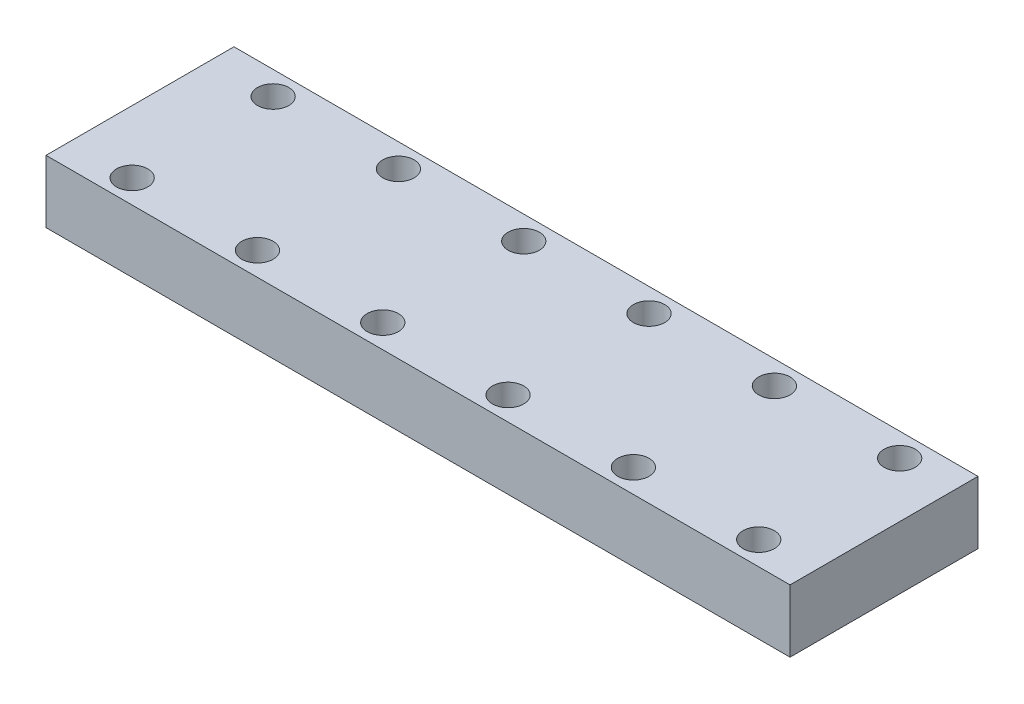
ISO-10303-21;
HEADER;
FILE_DESCRIPTION(('STEP AP214'),'2;1');
FILE_NAME('part.step','',(''),(''),'','','');
FILE_SCHEMA(('AUTOMOTIVE_DESIGN { 1 0 10303 214 1 1 1 1 }'));
ENDSEC;
DATA;
#1=APPLICATION_CONTEXT('core data for automotive mechanical design processes');
#2=APPLICATION_PROTOCOL_DEFINITION('international standard','automotive_design',2000,#1);
#3=PRODUCT_CONTEXT('',#1,'mechanical');
#4=PRODUCT('Part','Part','',(#3));
#5=PRODUCT_RELATED_PRODUCT_CATEGORY('part','',(#4));
#6=PRODUCT_DEFINITION_FORMATION('','',#4);
#7=PRODUCT_DEFINITION_CONTEXT('part definition',#1,'design');
#8=PRODUCT_DEFINITION('design','',#6,#7);
#9=PRODUCT_DEFINITION_SHAPE('','',#8);
#10=(LENGTH_UNIT() NAMED_UNIT(*) SI_UNIT(.MILLI.,.METRE.));
#11=(NAMED_UNIT(*) PLANE_ANGLE_UNIT() SI_UNIT($,.RADIAN.));
#12=(NAMED_UNIT(*) SI_UNIT($,.STERADIAN.) SOLID_ANGLE_UNIT());
#13=UNCERTAINTY_MEASURE_WITH_UNIT(LENGTH_MEASURE(1.E-05),#10,'distance_accuracy_value','');
#14=(GEOMETRIC_REPRESENTATION_CONTEXT(3) GLOBAL_UNCERTAINTY_ASSIGNED_CONTEXT((#13)) GLOBAL_UNIT_ASSIGNED_CONTEXT((#10,
#11,#12)) REPRESENTATION_CONTEXT('',''));
#15=CARTESIAN_POINT('',(0.,0.,0.));
#16=DIRECTION('',(0.,0.,1.));
#17=DIRECTION('',(1.,0.,0.));
#18=AXIS2_PLACEMENT_3D('',#15,#16,#17);
#19=CARTESIAN_POINT('',(0.,8.,0.));
#20=DIRECTION('',(0.,1.,0.));
#21=DIRECTION('',(0.,0.,1.));
#22=AXIS2_PLACEMENT_3D('',#19,#20,#21);
#23=PLANE('',#22);
#24=CARTESIAN_POINT('',(53.7092511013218,8.,7.83700440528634));
#25=DIRECTION('',(0.,1.,0.));
#26=DIRECTION('',(0.,0.,1.));
#27=AXIS2_PLACEMENT_3D('',#24,#25,#26);
#28=CIRCLE('',#27,2.);
#29=CARTESIAN_POINT('',(53.7092511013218,8.,9.83700440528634));
#30=VERTEX_POINT('',#29);
#31=EDGE_CURVE('E171',#30,#30,#28,.T.);
#32=ORIENTED_EDGE('',*,*,#31,.F.);
#33=EDGE_LOOP('',(#32));
#34=FACE_BOUND('',#33,.T.);
#35=CARTESIAN_POINT('',(21.7092511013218,8.,7.83700440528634));
#36=DIRECTION('',(0.,1.,0.));
#37=DIRECTION('',(0.,0.,1.));
#38=AXIS2_PLACEMENT_3D('',#35,#36,#37);
#39=CIRCLE('',#38,2.);
#40=CARTESIAN_POINT('',(21.7092511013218,8.,9.83700440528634));
#41=VERTEX_POINT('',#40);
#42=EDGE_CURVE('E159',#41,#41,#39,.T.);
#43=ORIENTED_EDGE('',*,*,#42,.F.);
#44=EDGE_LOOP('',(#43));
#45=FACE_BOUND('',#44,.T.);
#46=CARTESIAN_POINT('',(-10.2907488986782,8.,7.83700440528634));
#47=DIRECTION('',(0.,1.,0.));
#48=DIRECTION('',(0.,0.,1.));
#49=AXIS2_PLACEMENT_3D('',#46,#47,#48);
#50=CIRCLE('',#49,2.);
#51=CARTESIAN_POINT('',(-10.2907488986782,8.,9.83700440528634));
#52=VERTEX_POINT('',#51);
#53=EDGE_CURVE('E147',#52,#52,#50,.T.);
#54=ORIENTED_EDGE('',*,*,#53,.F.);
#55=EDGE_LOOP('',(#54));
#56=FACE_BOUND('',#55,.T.);
#57=CARTESIAN_POINT('',(53.7092511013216,8.,-10.1629955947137));
#58=DIRECTION('',(0.,1.,0.));
#59=DIRECTION('',(0.,0.,1.));
#60=AXIS2_PLACEMENT_3D('',#57,#58,#59);
#61=CIRCLE('',#60,2.);
#62=CARTESIAN_POINT('',(53.7092511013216,8.,-8.16299559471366));
#63=VERTEX_POINT('',#62);
#64=EDGE_CURVE('E135',#63,#63,#61,.T.);
#65=ORIENTED_EDGE('',*,*,#64,.F.);
#66=EDGE_LOOP('',(#65));
#67=FACE_BOUND('',#66,.T.);
#68=CARTESIAN_POINT('',(21.7092511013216,8.,-10.1629955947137));
#69=DIRECTION('',(0.,1.,0.));
#70=DIRECTION('',(0.,0.,1.));
#71=AXIS2_PLACEMENT_3D('',#68,#69,#70);
#72=CIRCLE('',#71,2.);
#73=CARTESIAN_POINT('',(21.7092511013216,8.,-8.16299559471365));
#74=VERTEX_POINT('',#73);
#75=EDGE_CURVE('E123',#74,#74,#72,.T.);
#76=ORIENTED_EDGE('',*,*,#75,.F.);
#77=EDGE_LOOP('',(#76));
#78=FACE_BOUND('',#77,.T.);
#79=CARTESIAN_POINT('',(-10.2907488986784,8.,-10.1629955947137));
#80=DIRECTION('',(0.,1.,0.));
#81=DIRECTION('',(0.,0.,1.));
#82=AXIS2_PLACEMENT_3D('',#79,#80,#81);
#83=CIRCLE('',#82,2.);
#84=CARTESIAN_POINT('',(-10.2907488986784,8.,-8.16299559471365));
#85=VERTEX_POINT('',#84);
#86=EDGE_CURVE('E102',#85,#85,#83,.T.);
#87=ORIENTED_EDGE('',*,*,#86,.F.);
#88=EDGE_LOOP('',(#87));
#89=FACE_BOUND('',#88,.T.);
#90=DIRECTION('',(0.,0.,1.));
#91=VECTOR('',#90,1.);
#92=CARTESIAN_POINT('',(-18.2907488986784,8.,-13.1629955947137));
#93=LINE('',#92,#91);
#94=CARTESIAN_POINT('',(-18.2907488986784,8.,-13.1629955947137));
#95=VERTEX_POINT('',#94);
#96=CARTESIAN_POINT('',(-18.2907488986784,8.,10.8370044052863));
#97=VERTEX_POINT('',#96);
#98=EDGE_CURVE('E87',#95,#97,#93,.T.);
#99=ORIENTED_EDGE('',*,*,#98,.T.);
#100=DIRECTION('',(1.,0.,0.));
#101=VECTOR('',#100,1.);
#102=CARTESIAN_POINT('',(-18.2907488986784,8.,10.8370044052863));
#103=LINE('',#102,#101);
#104=CARTESIAN_POINT('',(76.7092511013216,8.,10.8370044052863));
#105=VERTEX_POINT('',#104);
#106=EDGE_CURVE('E82',#97,#105,#103,.T.);
#107=ORIENTED_EDGE('',*,*,#106,.T.);
#108=DIRECTION('',(0.,0.,-1.));
#109=VECTOR('',#108,1.);
#110=CARTESIAN_POINT('',(76.7092511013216,8.,-13.1629955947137));
#111=LINE('',#110,#109);
#112=CARTESIAN_POINT('',(76.7092511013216,8.,-13.1629955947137));
#113=VERTEX_POINT('',#112);
#114=EDGE_CURVE('E85',#105,#113,#111,.T.);
#115=ORIENTED_EDGE('',*,*,#114,.T.);
#116=DIRECTION('',(-1.,0.,0.));
#117=VECTOR('',#116,1.);
#118=CARTESIAN_POINT('',(-18.2907488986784,8.,-13.1629955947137));
#119=LINE('',#118,#117);
#120=EDGE_CURVE('E52',#113,#95,#119,.T.);
#121=ORIENTED_EDGE('',*,*,#120,.T.);
#122=EDGE_LOOP('',(#99,#107,#115,#121));
#123=FACE_BOUND('',#122,.T.);
#124=CARTESIAN_POINT('',(5.70925110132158,8.,-10.1629955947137));
#125=DIRECTION('',(0.,1.,0.));
#126=DIRECTION('',(0.,0.,1.));
#127=AXIS2_PLACEMENT_3D('',#124,#125,#126);
#128=CIRCLE('',#127,2.);
#129=CARTESIAN_POINT('',(5.70925110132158,8.,-8.16299559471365));
#130=VERTEX_POINT('',#129);
#131=EDGE_CURVE('E117',#130,#130,#128,.T.);
#132=ORIENTED_EDGE('',*,*,#131,.F.);
#133=EDGE_LOOP('',(#132));
#134=FACE_BOUND('',#133,.T.);
#135=CARTESIAN_POINT('',(37.7092511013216,8.,-10.1629955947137));
#136=DIRECTION('',(0.,1.,0.));
#137=DIRECTION('',(0.,0.,1.));
#138=AXIS2_PLACEMENT_3D('',#135,#136,#137);
#139=CIRCLE('',#138,2.);
#140=CARTESIAN_POINT('',(37.7092511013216,8.,-8.16299559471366));
#141=VERTEX_POINT('',#140);
#142=EDGE_CURVE('E129',#141,#141,#139,.T.);
#143=ORIENTED_EDGE('',*,*,#142,.F.);
#144=EDGE_LOOP('',(#143));
#145=FACE_BOUND('',#144,.T.);
#146=CARTESIAN_POINT('',(69.7092511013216,8.,-10.1629955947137));
#147=DIRECTION('',(0.,1.,0.));
#148=DIRECTION('',(0.,0.,1.));
#149=AXIS2_PLACEMENT_3D('',#146,#147,#148);
#150=CIRCLE('',#149,2.);
#151=CARTESIAN_POINT('',(69.7092511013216,8.,-8.16299559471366));
#152=VERTEX_POINT('',#151);
#153=EDGE_CURVE('E141',#152,#152,#150,.T.);
#154=ORIENTED_EDGE('',*,*,#153,.F.);
#155=EDGE_LOOP('',(#154));
#156=FACE_BOUND('',#155,.T.);
#157=CARTESIAN_POINT('',(5.70925110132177,8.,7.83700440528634));
#158=DIRECTION('',(0.,1.,0.));
#159=DIRECTION('',(0.,0.,1.));
#160=AXIS2_PLACEMENT_3D('',#157,#158,#159);
#161=CIRCLE('',#160,2.);
#162=CARTESIAN_POINT('',(5.70925110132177,8.,9.83700440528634));
#163=VERTEX_POINT('',#162);
#164=EDGE_CURVE('E153',#163,#163,#161,.T.);
#165=ORIENTED_EDGE('',*,*,#164,.F.);
#166=EDGE_LOOP('',(#165));
#167=FACE_BOUND('',#166,.T.);
#168=CARTESIAN_POINT('',(37.7092511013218,8.,7.83700440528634));
#169=DIRECTION('',(0.,1.,0.));
#170=DIRECTION('',(0.,0.,1.));
#171=AXIS2_PLACEMENT_3D('',#168,#169,#170);
#172=CIRCLE('',#171,2.);
#173=CARTESIAN_POINT('',(37.7092511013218,8.,9.83700440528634));
#174=VERTEX_POINT('',#173);
#175=EDGE_CURVE('E165',#174,#174,#172,.T.);
#176=ORIENTED_EDGE('',*,*,#175,.F.);
#177=EDGE_LOOP('',(#176));
#178=FACE_BOUND('',#177,.T.);
#179=CARTESIAN_POINT('',(69.7092511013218,8.,7.83700440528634));
#180=DIRECTION('',(0.,1.,0.));
#181=DIRECTION('',(0.,0.,1.));
#182=AXIS2_PLACEMENT_3D('',#179,#180,#181);
#183=CIRCLE('',#182,2.);
#184=CARTESIAN_POINT('',(69.7092511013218,8.,9.83700440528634));
#185=VERTEX_POINT('',#184);
#186=EDGE_CURVE('E177',#185,#185,#183,.T.);
#187=ORIENTED_EDGE('',*,*,#186,.F.);
#188=EDGE_LOOP('',(#187));
#189=FACE_BOUND('',#188,.T.);
#190=ADVANCED_FACE('F35',(#34,#45,#56,#67,#78,#89,#123,#134,#145,#156,#167,#178,#189),#23,.T.);
#191=CARTESIAN_POINT('',(0.,0.,0.));
#192=DIRECTION('',(0.,1.,0.));
#193=DIRECTION('',(0.,0.,1.));
#194=AXIS2_PLACEMENT_3D('',#191,#192,#193);
#195=PLANE('',#194);
#196=DIRECTION('',(0.,0.,1.));
#197=VECTOR('',#196,1.);
#198=CARTESIAN_POINT('',(-18.2907488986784,0.,-13.1629955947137));
#199=LINE('',#198,#197);
#200=CARTESIAN_POINT('',(-18.2907488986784,0.,-13.1629955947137));
#201=VERTEX_POINT('',#200);
#202=CARTESIAN_POINT('',(-18.2907488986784,0.,10.8370044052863));
#203=VERTEX_POINT('',#202);
#204=EDGE_CURVE('E99',#201,#203,#199,.T.);
#205=ORIENTED_EDGE('',*,*,#204,.F.);
#206=DIRECTION('',(-1.,0.,0.));
#207=VECTOR('',#206,1.);
#208=CARTESIAN_POINT('',(-18.2907488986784,0.,-13.1629955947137));
#209=LINE('',#208,#207);
#210=CARTESIAN_POINT('',(76.7092511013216,0.,-13.1629955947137));
#211=VERTEX_POINT('',#210);
#212=EDGE_CURVE('E75',#211,#201,#209,.T.);
#213=ORIENTED_EDGE('',*,*,#212,.F.);
#214=DIRECTION('',(0.,0.,-1.));
#215=VECTOR('',#214,1.);
#216=CARTESIAN_POINT('',(76.7092511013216,0.,-13.1629955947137));
#217=LINE('',#216,#215);
#218=CARTESIAN_POINT('',(76.7092511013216,0.,10.8370044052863));
#219=VERTEX_POINT('',#218);
#220=EDGE_CURVE('E69',#219,#211,#217,.T.);
#221=ORIENTED_EDGE('',*,*,#220,.F.);
#222=DIRECTION('',(1.,0.,0.));
#223=VECTOR('',#222,1.);
#224=CARTESIAN_POINT('',(-18.2907488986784,0.,10.8370044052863));
#225=LINE('',#224,#223);
#226=EDGE_CURVE('E91',#203,#219,#225,.T.);
#227=ORIENTED_EDGE('',*,*,#226,.F.);
#228=EDGE_LOOP('',(#205,#213,#221,#227));
#229=FACE_BOUND('',#228,.T.);
#230=CARTESIAN_POINT('',(-10.2907488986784,0.,-10.1629955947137));
#231=DIRECTION('',(0.,1.,0.));
#232=DIRECTION('',(0.,0.,1.));
#233=AXIS2_PLACEMENT_3D('',#230,#231,#232);
#234=CIRCLE('',#233,2.);
#235=CARTESIAN_POINT('',(-10.2907488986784,0.,-8.16299559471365));
#236=VERTEX_POINT('',#235);
#237=EDGE_CURVE('E114',#236,#236,#234,.T.);
#238=ORIENTED_EDGE('',*,*,#237,.T.);
#239=EDGE_LOOP('',(#238));
#240=FACE_BOUND('',#239,.T.);
#241=CARTESIAN_POINT('',(5.70925110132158,0.,-10.1629955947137));
#242=DIRECTION('',(0.,1.,0.));
#243=DIRECTION('',(0.,0.,1.));
#244=AXIS2_PLACEMENT_3D('',#241,#242,#243);
#245=CIRCLE('',#244,2.);
#246=CARTESIAN_POINT('',(5.70925110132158,0.,-8.16299559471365));
#247=VERTEX_POINT('',#246);
#248=EDGE_CURVE('E120',#247,#247,#245,.T.);
#249=ORIENTED_EDGE('',*,*,#248,.T.);
#250=EDGE_LOOP('',(#249));
#251=FACE_BOUND('',#250,.T.);
#252=CARTESIAN_POINT('',(21.7092511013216,0.,-10.1629955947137));
#253=DIRECTION('',(0.,1.,0.));
#254=DIRECTION('',(0.,0.,1.));
#255=AXIS2_PLACEMENT_3D('',#252,#253,#254);
#256=CIRCLE('',#255,2.);
#257=CARTESIAN_POINT('',(21.7092511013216,0.,-8.16299559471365));
#258=VERTEX_POINT('',#257);
#259=EDGE_CURVE('E126',#258,#258,#256,.T.);
#260=ORIENTED_EDGE('',*,*,#259,.T.);
#261=EDGE_LOOP('',(#260));
#262=FACE_BOUND('',#261,.T.);
#263=CARTESIAN_POINT('',(37.7092511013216,0.,-10.1629955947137));
#264=DIRECTION('',(0.,1.,0.));
#265=DIRECTION('',(0.,0.,1.));
#266=AXIS2_PLACEMENT_3D('',#263,#264,#265);
#267=CIRCLE('',#266,2.);
#268=CARTESIAN_POINT('',(37.7092511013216,0.,-8.16299559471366));
#269=VERTEX_POINT('',#268);
#270=EDGE_CURVE('E132',#269,#269,#267,.T.);
#271=ORIENTED_EDGE('',*,*,#270,.T.);
#272=EDGE_LOOP('',(#271));
#273=FACE_BOUND('',#272,.T.);
#274=CARTESIAN_POINT('',(53.7092511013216,0.,-10.1629955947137));
#275=DIRECTION('',(0.,1.,0.));
#276=DIRECTION('',(0.,0.,1.));
#277=AXIS2_PLACEMENT_3D('',#274,#275,#276);
#278=CIRCLE('',#277,2.);
#279=CARTESIAN_POINT('',(53.7092511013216,0.,-8.16299559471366));
#280=VERTEX_POINT('',#279);
#281=EDGE_CURVE('E138',#280,#280,#278,.T.);
#282=ORIENTED_EDGE('',*,*,#281,.T.);
#283=EDGE_LOOP('',(#282));
#284=FACE_BOUND('',#283,.T.);
#285=CARTESIAN_POINT('',(69.7092511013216,0.,-10.1629955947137));
#286=DIRECTION('',(0.,1.,0.));
#287=DIRECTION('',(0.,0.,1.));
#288=AXIS2_PLACEMENT_3D('',#285,#286,#287);
#289=CIRCLE('',#288,2.);
#290=CARTESIAN_POINT('',(69.7092511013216,0.,-8.16299559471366));
#291=VERTEX_POINT('',#290);
#292=EDGE_CURVE('E144',#291,#291,#289,.T.);
#293=ORIENTED_EDGE('',*,*,#292,.T.);
#294=EDGE_LOOP('',(#293));
#295=FACE_BOUND('',#294,.T.);
#296=CARTESIAN_POINT('',(-10.2907488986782,0.,7.83700440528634));
#297=DIRECTION('',(0.,1.,0.));
#298=DIRECTION('',(0.,0.,1.));
#299=AXIS2_PLACEMENT_3D('',#296,#297,#298);
#300=CIRCLE('',#299,2.);
#301=CARTESIAN_POINT('',(-10.2907488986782,0.,9.83700440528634));
#302=VERTEX_POINT('',#301);
#303=EDGE_CURVE('E150',#302,#302,#300,.T.);
#304=ORIENTED_EDGE('',*,*,#303,.T.);
#305=EDGE_LOOP('',(#304));
#306=FACE_BOUND('',#305,.T.);
#307=CARTESIAN_POINT('',(5.70925110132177,0.,7.83700440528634));
#308=DIRECTION('',(0.,1.,0.));
#309=DIRECTION('',(0.,0.,1.));
#310=AXIS2_PLACEMENT_3D('',#307,#308,#309);
#311=CIRCLE('',#310,2.);
#312=CARTESIAN_POINT('',(5.70925110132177,0.,9.83700440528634));
#313=VERTEX_POINT('',#312);
#314=EDGE_CURVE('E156',#313,#313,#311,.T.);
#315=ORIENTED_EDGE('',*,*,#314,.T.);
#316=EDGE_LOOP('',(#315));
#317=FACE_BOUND('',#316,.T.);
#318=CARTESIAN_POINT('',(21.7092511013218,0.,7.83700440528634));
#319=DIRECTION('',(0.,1.,0.));
#320=DIRECTION('',(0.,0.,1.));
#321=AXIS2_PLACEMENT_3D('',#318,#319,#320);
#322=CIRCLE('',#321,2.);
#323=CARTESIAN_POINT('',(21.7092511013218,0.,9.83700440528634));
#324=VERTEX_POINT('',#323);
#325=EDGE_CURVE('E162',#324,#324,#322,.T.);
#326=ORIENTED_EDGE('',*,*,#325,.T.);
#327=EDGE_LOOP('',(#326));
#328=FACE_BOUND('',#327,.T.);
#329=CARTESIAN_POINT('',(37.7092511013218,0.,7.83700440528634));
#330=DIRECTION('',(0.,1.,0.));
#331=DIRECTION('',(0.,0.,1.));
#332=AXIS2_PLACEMENT_3D('',#329,#330,#331);
#333=CIRCLE('',#332,2.);
#334=CARTESIAN_POINT('',(37.7092511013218,0.,9.83700440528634));
#335=VERTEX_POINT('',#334);
#336=EDGE_CURVE('E168',#335,#335,#333,.T.);
#337=ORIENTED_EDGE('',*,*,#336,.T.);
#338=EDGE_LOOP('',(#337));
#339=FACE_BOUND('',#338,.T.);
#340=CARTESIAN_POINT('',(53.7092511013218,0.,7.83700440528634));
#341=DIRECTION('',(0.,1.,0.));
#342=DIRECTION('',(0.,0.,1.));
#343=AXIS2_PLACEMENT_3D('',#340,#341,#342);
#344=CIRCLE('',#343,2.);
#345=CARTESIAN_POINT('',(53.7092511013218,0.,9.83700440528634));
#346=VERTEX_POINT('',#345);
#347=EDGE_CURVE('E174',#346,#346,#344,.T.);
#348=ORIENTED_EDGE('',*,*,#347,.T.);
#349=EDGE_LOOP('',(#348));
#350=FACE_BOUND('',#349,.T.);
#351=CARTESIAN_POINT('',(69.7092511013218,0.,7.83700440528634));
#352=DIRECTION('',(0.,1.,0.));
#353=DIRECTION('',(0.,0.,1.));
#354=AXIS2_PLACEMENT_3D('',#351,#352,#353);
#355=CIRCLE('',#354,2.);
#356=CARTESIAN_POINT('',(69.7092511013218,0.,9.83700440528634));
#357=VERTEX_POINT('',#356);
#358=EDGE_CURVE('E180',#357,#357,#355,.T.);
#359=ORIENTED_EDGE('',*,*,#358,.T.);
#360=EDGE_LOOP('',(#359));
#361=FACE_BOUND('',#360,.T.);
#362=ADVANCED_FACE('F110',(#229,#240,#251,#262,#273,#284,#295,#306,#317,#328,#339,#350,#361),
#195,.F.);
#363=CARTESIAN_POINT('',(-18.2907488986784,8.,-13.1629955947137));
#364=DIRECTION('',(1.,0.,0.));
#365=DIRECTION('',(0.,0.,-1.));
#366=AXIS2_PLACEMENT_3D('',#363,#364,#365);
#367=PLANE('',#366);
#368=ORIENTED_EDGE('',*,*,#204,.T.);
#369=DIRECTION('',(0.,-1.,0.));
#370=VECTOR('',#369,1.);
#371=CARTESIAN_POINT('',(-18.2907488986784,8.,10.8370044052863));
#372=LINE('',#371,#370);
#373=EDGE_CURVE('E11',#97,#203,#372,.T.);
#374=ORIENTED_EDGE('',*,*,#373,.F.);
#375=ORIENTED_EDGE('',*,*,#98,.F.);
#376=DIRECTION('',(0.,-1.,0.));
#377=VECTOR('',#376,1.);
#378=CARTESIAN_POINT('',(-18.2907488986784,8.,-13.1629955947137));
#379=LINE('',#378,#377);
#380=EDGE_CURVE('E95',#95,#201,#379,.T.);
#381=ORIENTED_EDGE('',*,*,#380,.T.);
#382=EDGE_LOOP('',(#368,#374,#375,#381));
#383=FACE_BOUND('',#382,.T.);
#384=ADVANCED_FACE('F37',(#383),#367,.F.);
#385=CARTESIAN_POINT('',(-18.2907488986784,8.,10.8370044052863));
#386=DIRECTION('',(0.,0.,-1.));
#387=DIRECTION('',(-1.,0.,0.));
#388=AXIS2_PLACEMENT_3D('',#385,#386,#387);
#389=PLANE('',#388);
#390=ORIENTED_EDGE('',*,*,#226,.T.);
#391=DIRECTION('',(0.,-1.,0.));
#392=VECTOR('',#391,1.);
#393=CARTESIAN_POINT('',(76.7092511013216,8.,10.8370044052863));
#394=LINE('',#393,#392);
#395=EDGE_CURVE('E44',#105,#219,#394,.T.);
#396=ORIENTED_EDGE('',*,*,#395,.F.);
#397=ORIENTED_EDGE('',*,*,#106,.F.);
#398=ORIENTED_EDGE('',*,*,#373,.T.);
#399=EDGE_LOOP('',(#390,#396,#397,#398));
#400=FACE_BOUND('',#399,.T.);
#401=ADVANCED_FACE('F90',(#400),#389,.F.);
#402=CARTESIAN_POINT('',(76.7092511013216,8.,-13.1629955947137));
#403=DIRECTION('',(-1.,0.,0.));
#404=DIRECTION('',(0.,0.,1.));
#405=AXIS2_PLACEMENT_3D('',#402,#403,#404);
#406=PLANE('',#405);
#407=ORIENTED_EDGE('',*,*,#220,.T.);
#408=DIRECTION('',(0.,-1.,0.));
#409=VECTOR('',#408,1.);
#410=CARTESIAN_POINT('',(76.7092511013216,8.,-13.1629955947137));
#411=LINE('',#410,#409);
#412=EDGE_CURVE('E92',#113,#211,#411,.T.);
#413=ORIENTED_EDGE('',*,*,#412,.F.);
#414=ORIENTED_EDGE('',*,*,#114,.F.);
#415=ORIENTED_EDGE('',*,*,#395,.T.);
#416=EDGE_LOOP('',(#407,#413,#414,#415));
#417=FACE_BOUND('',#416,.T.);
#418=ADVANCED_FACE('F93',(#417),#406,.F.);
#419=CARTESIAN_POINT('',(-18.2907488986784,8.,-13.1629955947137));
#420=DIRECTION('',(0.,0.,1.));
#421=DIRECTION('',(1.,0.,0.));
#422=AXIS2_PLACEMENT_3D('',#419,#420,#421);
#423=PLANE('',#422);
#424=ORIENTED_EDGE('',*,*,#212,.T.);
#425=ORIENTED_EDGE('',*,*,#380,.F.);
#426=ORIENTED_EDGE('',*,*,#120,.F.);
#427=ORIENTED_EDGE('',*,*,#412,.T.);
#428=EDGE_LOOP('',(#424,#425,#426,#427));
#429=FACE_BOUND('',#428,.T.);
#430=ADVANCED_FACE('F107',(#429),#423,.F.);
#431=CARTESIAN_POINT('',(-10.2907488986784,8.,-10.1629955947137));
#432=DIRECTION('',(0.,-1.,0.));
#433=DIRECTION('',(0.,0.,-1.));
#434=AXIS2_PLACEMENT_3D('',#431,#432,#433);
#435=CYLINDRICAL_SURFACE('',#434,2.);
#436=ORIENTED_EDGE('',*,*,#86,.T.);
#437=EDGE_LOOP('',(#436));
#438=FACE_BOUND('',#437,.T.);
#439=ORIENTED_EDGE('',*,*,#237,.F.);
#440=EDGE_LOOP('',(#439));
#441=FACE_BOUND('',#440,.T.);
#442=ADVANCED_FACE('F199',(#438,#441),#435,.F.);
#443=CARTESIAN_POINT('',(5.70925110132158,8.,-10.1629955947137));
#444=DIRECTION('',(0.,-1.,0.));
#445=DIRECTION('',(0.,0.,-1.));
#446=AXIS2_PLACEMENT_3D('',#443,#444,#445);
#447=CYLINDRICAL_SURFACE('',#446,2.);
#448=ORIENTED_EDGE('',*,*,#131,.T.);
#449=EDGE_LOOP('',(#448));
#450=FACE_BOUND('',#449,.T.);
#451=ORIENTED_EDGE('',*,*,#248,.F.);
#452=EDGE_LOOP('',(#451));
#453=FACE_BOUND('',#452,.T.);
#454=ADVANCED_FACE('F245',(#450,#453),#447,.F.);
#455=CARTESIAN_POINT('',(21.7092511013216,8.,-10.1629955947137));
#456=DIRECTION('',(0.,-1.,0.));
#457=DIRECTION('',(0.,0.,-1.));
#458=AXIS2_PLACEMENT_3D('',#455,#456,#457);
#459=CYLINDRICAL_SURFACE('',#458,2.);
#460=ORIENTED_EDGE('',*,*,#75,.T.);
#461=EDGE_LOOP('',(#460));
#462=FACE_BOUND('',#461,.T.);
#463=ORIENTED_EDGE('',*,*,#259,.F.);
#464=EDGE_LOOP('',(#463));
#465=FACE_BOUND('',#464,.T.);
#466=ADVANCED_FACE('F253',(#462,#465),#459,.F.);
#467=CARTESIAN_POINT('',(37.7092511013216,8.,-10.1629955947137));
#468=DIRECTION('',(0.,-1.,0.));
#469=DIRECTION('',(0.,0.,-1.));
#470=AXIS2_PLACEMENT_3D('',#467,#468,#469);
#471=CYLINDRICAL_SURFACE('',#470,2.);
#472=ORIENTED_EDGE('',*,*,#142,.T.);
#473=EDGE_LOOP('',(#472));
#474=FACE_BOUND('',#473,.T.);
#475=ORIENTED_EDGE('',*,*,#270,.F.);
#476=EDGE_LOOP('',(#475));
#477=FACE_BOUND('',#476,.T.);
#478=ADVANCED_FACE('F261',(#474,#477),#471,.F.);
#479=CARTESIAN_POINT('',(53.7092511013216,8.,-10.1629955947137));
#480=DIRECTION('',(0.,-1.,0.));
#481=DIRECTION('',(0.,0.,-1.));
#482=AXIS2_PLACEMENT_3D('',#479,#480,#481);
#483=CYLINDRICAL_SURFACE('',#482,2.);
#484=ORIENTED_EDGE('',*,*,#64,.T.);
#485=EDGE_LOOP('',(#484));
#486=FACE_BOUND('',#485,.T.);
#487=ORIENTED_EDGE('',*,*,#281,.F.);
#488=EDGE_LOOP('',(#487));
#489=FACE_BOUND('',#488,.T.);
#490=ADVANCED_FACE('F270',(#486,#489),#483,.F.);
#491=CARTESIAN_POINT('',(69.7092511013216,8.,-10.1629955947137));
#492=DIRECTION('',(0.,-1.,0.));
#493=DIRECTION('',(0.,0.,-1.));
#494=AXIS2_PLACEMENT_3D('',#491,#492,#493);
#495=CYLINDRICAL_SURFACE('',#494,2.);
#496=ORIENTED_EDGE('',*,*,#153,.T.);
#497=EDGE_LOOP('',(#496));
#498=FACE_BOUND('',#497,.T.);
#499=ORIENTED_EDGE('',*,*,#292,.F.);
#500=EDGE_LOOP('',(#499));
#501=FACE_BOUND('',#500,.T.);
#502=ADVANCED_FACE('F279',(#498,#501),#495,.F.);
#503=CARTESIAN_POINT('',(-10.2907488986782,8.,7.83700440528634));
#504=DIRECTION('',(0.,-1.,0.));
#505=DIRECTION('',(0.,0.,-1.));
#506=AXIS2_PLACEMENT_3D('',#503,#504,#505);
#507=CYLINDRICAL_SURFACE('',#506,2.);
#508=ORIENTED_EDGE('',*,*,#53,.T.);
#509=EDGE_LOOP('',(#508));
#510=FACE_BOUND('',#509,.T.);
#511=ORIENTED_EDGE('',*,*,#303,.F.);
#512=EDGE_LOOP('',(#511));
#513=FACE_BOUND('',#512,.T.);
#514=ADVANCED_FACE('F288',(#510,#513),#507,.F.);
#515=CARTESIAN_POINT('',(5.70925110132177,8.,7.83700440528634));
#516=DIRECTION('',(0.,-1.,0.));
#517=DIRECTION('',(0.,0.,-1.));
#518=AXIS2_PLACEMENT_3D('',#515,#516,#517);
#519=CYLINDRICAL_SURFACE('',#518,2.);
#520=ORIENTED_EDGE('',*,*,#164,.T.);
#521=EDGE_LOOP('',(#520));
#522=FACE_BOUND('',#521,.T.);
#523=ORIENTED_EDGE('',*,*,#314,.F.);
#524=EDGE_LOOP('',(#523));
#525=FACE_BOUND('',#524,.T.);
#526=ADVANCED_FACE('F297',(#522,#525),#519,.F.);
#527=CARTESIAN_POINT('',(21.7092511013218,8.,7.83700440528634));
#528=DIRECTION('',(0.,-1.,0.));
#529=DIRECTION('',(0.,0.,-1.));
#530=AXIS2_PLACEMENT_3D('',#527,#528,#529);
#531=CYLINDRICAL_SURFACE('',#530,2.);
#532=ORIENTED_EDGE('',*,*,#42,.T.);
#533=EDGE_LOOP('',(#532));
#534=FACE_BOUND('',#533,.T.);
#535=ORIENTED_EDGE('',*,*,#325,.F.);
#536=EDGE_LOOP('',(#535));
#537=FACE_BOUND('',#536,.T.);
#538=ADVANCED_FACE('F306',(#534,#537),#531,.F.);
#539=CARTESIAN_POINT('',(37.7092511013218,8.,7.83700440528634));
#540=DIRECTION('',(0.,-1.,0.));
#541=DIRECTION('',(0.,0.,-1.));
#542=AXIS2_PLACEMENT_3D('',#539,#540,#541);
#543=CYLINDRICAL_SURFACE('',#542,2.);
#544=ORIENTED_EDGE('',*,*,#175,.T.);
#545=EDGE_LOOP('',(#544));
#546=FACE_BOUND('',#545,.T.);
#547=ORIENTED_EDGE('',*,*,#336,.F.);
#548=EDGE_LOOP('',(#547));
#549=FACE_BOUND('',#548,.T.);
#550=ADVANCED_FACE('F315',(#546,#549),#543,.F.);
#551=CARTESIAN_POINT('',(53.7092511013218,8.,7.83700440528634));
#552=DIRECTION('',(0.,-1.,0.));
#553=DIRECTION('',(0.,0.,-1.));
#554=AXIS2_PLACEMENT_3D('',#551,#552,#553);
#555=CYLINDRICAL_SURFACE('',#554,2.);
#556=ORIENTED_EDGE('',*,*,#31,.T.);
#557=EDGE_LOOP('',(#556));
#558=FACE_BOUND('',#557,.T.);
#559=ORIENTED_EDGE('',*,*,#347,.F.);
#560=EDGE_LOOP('',(#559));
#561=FACE_BOUND('',#560,.T.);
#562=ADVANCED_FACE('F324',(#558,#561),#555,.F.);
#563=CARTESIAN_POINT('',(69.7092511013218,8.,7.83700440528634));
#564=DIRECTION('',(0.,-1.,0.));
#565=DIRECTION('',(0.,0.,-1.));
#566=AXIS2_PLACEMENT_3D('',#563,#564,#565);
#567=CYLINDRICAL_SURFACE('',#566,2.);
#568=ORIENTED_EDGE('',*,*,#186,.T.);
#569=EDGE_LOOP('',(#568));
#570=FACE_BOUND('',#569,.T.);
#571=ORIENTED_EDGE('',*,*,#358,.F.);
#572=EDGE_LOOP('',(#571));
#573=FACE_BOUND('',#572,.T.);
#574=ADVANCED_FACE('F186',(#570,#573),#567,.F.);
#575=CLOSED_SHELL('',(#190,#362,#384,#401,#418,#430,#442,#454,#466,#478,#490,#502,#514,#526,
#538,#550,#562,#574));
#576=MANIFOLD_SOLID_BREP('B2',#575);
#577=ADVANCED_BREP_SHAPE_REPRESENTATION('',(#18,#576),#14);
#578=SHAPE_DEFINITION_REPRESENTATION(#9,#577);
ENDSEC;
END-ISO-10303-21;
